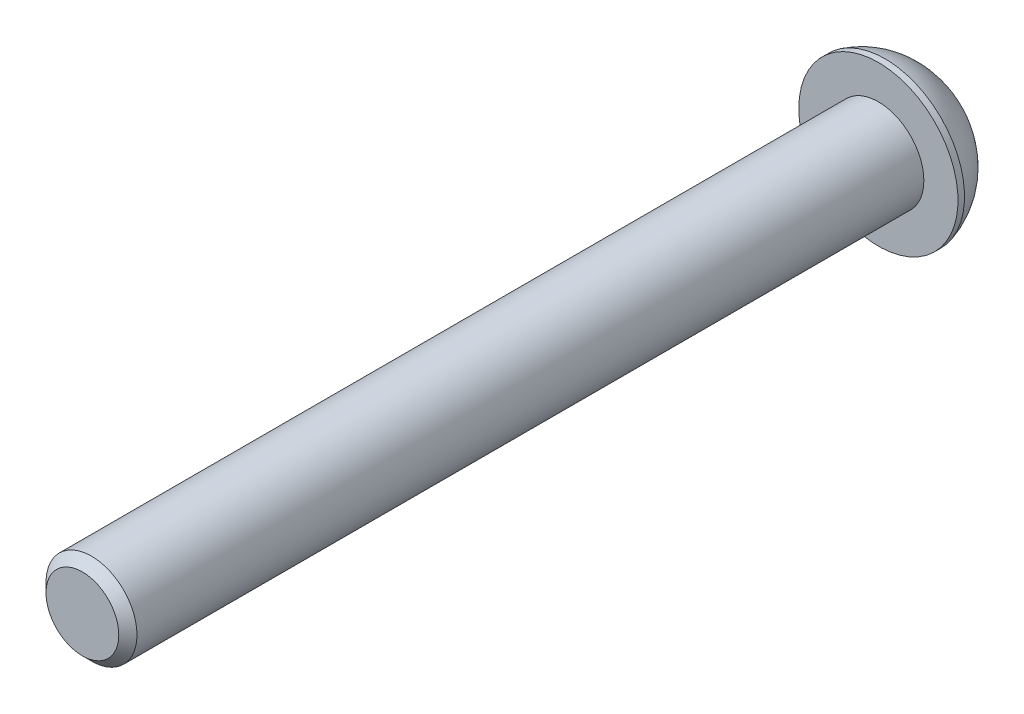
ISO-10303-21;
HEADER;
FILE_DESCRIPTION(('STEP AP214'),'2;1');
FILE_NAME('part.step','',(''),(''),'','','');
FILE_SCHEMA(('AUTOMOTIVE_DESIGN { 1 0 10303 214 1 1 1 1 }'));
ENDSEC;
DATA;
#1=APPLICATION_CONTEXT('core data for automotive mechanical design processes');
#2=APPLICATION_PROTOCOL_DEFINITION('international standard','automotive_design',2000,#1);
#3=PRODUCT_CONTEXT('',#1,'mechanical');
#4=PRODUCT('Part','Part','',(#3));
#5=PRODUCT_RELATED_PRODUCT_CATEGORY('part','',(#4));
#6=PRODUCT_DEFINITION_FORMATION('','',#4);
#7=PRODUCT_DEFINITION_CONTEXT('part definition',#1,'design');
#8=PRODUCT_DEFINITION('design','',#6,#7);
#9=PRODUCT_DEFINITION_SHAPE('','',#8);
#10=(LENGTH_UNIT() NAMED_UNIT(*) SI_UNIT(.MILLI.,.METRE.));
#11=(NAMED_UNIT(*) PLANE_ANGLE_UNIT() SI_UNIT($,.RADIAN.));
#12=(NAMED_UNIT(*) SI_UNIT($,.STERADIAN.) SOLID_ANGLE_UNIT());
#13=UNCERTAINTY_MEASURE_WITH_UNIT(LENGTH_MEASURE(1.E-05),#10,'distance_accuracy_value','');
#14=(GEOMETRIC_REPRESENTATION_CONTEXT(3) GLOBAL_UNCERTAINTY_ASSIGNED_CONTEXT((#13)) GLOBAL_UNIT_ASSIGNED_CONTEXT((#10,
#11,#12)) REPRESENTATION_CONTEXT('',''));
#15=CARTESIAN_POINT('',(0.,0.,0.));
#16=DIRECTION('',(0.,0.,1.));
#17=DIRECTION('',(1.,0.,0.));
#18=AXIS2_PLACEMENT_3D('',#15,#16,#17);
#19=CARTESIAN_POINT('',(0.,0.,-4.4));
#20=DIRECTION('',(0.,0.,1.));
#21=DIRECTION('',(1.,0.,0.));
#22=AXIS2_PLACEMENT_3D('',#19,#20,#21);
#23=PLANE('',#22);
#24=CARTESIAN_POINT('',(0.,0.,-4.4));
#25=DIRECTION('',(0.,0.,-1.));
#26=DIRECTION('',(-1.,0.,0.));
#27=AXIS2_PLACEMENT_3D('',#24,#25,#26);
#28=CIRCLE('',#27,4.06492341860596);
#29=CARTESIAN_POINT('',(-4.06492341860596,0.,-4.4));
#30=VERTEX_POINT('',#29);
#31=EDGE_CURVE('E148',#30,#30,#28,.T.);
#32=ORIENTED_EDGE('',*,*,#31,.T.);
#33=EDGE_LOOP('',(#32));
#34=FACE_BOUND('',#33,.T.);
#35=DIRECTION('',(-0.86602540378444,0.499999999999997,0.));
#36=VECTOR('',#35,1.);
#37=CARTESIAN_POINT('',(0.,2.88675134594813,-4.4));
#38=LINE('',#37,#36);
#39=CARTESIAN_POINT('',(2.5,1.44337567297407,-4.4));
#40=VERTEX_POINT('',#39);
#41=CARTESIAN_POINT('',(0.,2.88675134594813,-4.4));
#42=VERTEX_POINT('',#41);
#43=EDGE_CURVE('E50',#40,#42,#38,.T.);
#44=ORIENTED_EDGE('',*,*,#43,.T.);
#45=DIRECTION('',(-0.866025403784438,-0.500000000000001,0.));
#46=VECTOR('',#45,1.);
#47=CARTESIAN_POINT('',(0.,2.88675134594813,-4.4));
#48=LINE('',#47,#46);
#49=CARTESIAN_POINT('',(-2.5,1.44337567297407,-4.4));
#50=VERTEX_POINT('',#49);
#51=EDGE_CURVE('E121',#42,#50,#48,.T.);
#52=ORIENTED_EDGE('',*,*,#51,.T.);
#53=DIRECTION('',(0.,-1.,0.));
#54=VECTOR('',#53,1.);
#55=CARTESIAN_POINT('',(-2.5,-1.44337567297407,-4.4));
#56=LINE('',#55,#54);
#57=CARTESIAN_POINT('',(-2.5,-1.44337567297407,-4.4));
#58=VERTEX_POINT('',#57);
#59=EDGE_CURVE('E125',#50,#58,#56,.T.);
#60=ORIENTED_EDGE('',*,*,#59,.T.);
#61=DIRECTION('',(0.866025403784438,-0.500000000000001,0.));
#62=VECTOR('',#61,1.);
#63=CARTESIAN_POINT('',(0.,-2.88675134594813,-4.4));
#64=LINE('',#63,#62);
#65=CARTESIAN_POINT('',(0.,-2.88675134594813,-4.4));
#66=VERTEX_POINT('',#65);
#67=EDGE_CURVE('E128',#58,#66,#64,.T.);
#68=ORIENTED_EDGE('',*,*,#67,.T.);
#69=DIRECTION('',(0.86602540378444,0.499999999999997,0.));
#70=VECTOR('',#69,1.);
#71=CARTESIAN_POINT('',(0.,-2.88675134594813,-4.4));
#72=LINE('',#71,#70);
#73=CARTESIAN_POINT('',(2.5,-1.44337567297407,-4.4));
#74=VERTEX_POINT('',#73);
#75=EDGE_CURVE('E111',#66,#74,#72,.T.);
#76=ORIENTED_EDGE('',*,*,#75,.T.);
#77=DIRECTION('',(0.,1.,0.));
#78=VECTOR('',#77,1.);
#79=CARTESIAN_POINT('',(2.5,-1.44337567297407,-4.4));
#80=LINE('',#79,#78);
#81=EDGE_CURVE('E131',#74,#40,#80,.T.);
#82=ORIENTED_EDGE('',*,*,#81,.T.);
#83=EDGE_LOOP('',(#44,#52,#60,#68,#76,#82));
#84=FACE_BOUND('',#83,.T.);
#85=ADVANCED_FACE('F35',(#34,#84),#23,.F.);
#86=CARTESIAN_POINT('',(0.,0.,1.05548398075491));
#87=DIRECTION('',(0.,0.,-1.));
#88=DIRECTION('',(-1.,0.,0.));
#89=AXIS2_PLACEMENT_3D('',#86,#87,#88);
#90=DEGENERATE_TOROIDAL_SURFACE('',#89,0.915198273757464,6.29945028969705,.T.);
#91=ORIENTED_EDGE('',*,*,#31,.F.);
#92=EDGE_LOOP('',(#91));
#93=FACE_BOUND('',#92,.T.);
#94=CARTESIAN_POINT('',(0.,0.,-0.574933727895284));
#95=DIRECTION('',(0.,0.,-1.));
#96=DIRECTION('',(-1.,0.,0.));
#97=AXIS2_PLACEMENT_3D('',#94,#95,#96);
#98=CIRCLE('',#97,7.);
#99=CARTESIAN_POINT('',(-7.,0.,-0.574933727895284));
#100=VERTEX_POINT('',#99);
#101=EDGE_CURVE('E145',#100,#100,#98,.T.);
#102=ORIENTED_EDGE('',*,*,#101,.T.);
#103=EDGE_LOOP('',(#102));
#104=FACE_BOUND('',#103,.T.);
#105=ADVANCED_FACE('F165',(#93,#104),#90,.T.);
#106=CARTESIAN_POINT('',(0.,0.,0.));
#107=DIRECTION('',(0.,0.,-1.));
#108=DIRECTION('',(-1.,0.,0.));
#109=AXIS2_PLACEMENT_3D('',#106,#107,#108);
#110=CYLINDRICAL_SURFACE('',#109,7.);
#111=ORIENTED_EDGE('',*,*,#101,.F.);
#112=EDGE_LOOP('',(#111));
#113=FACE_BOUND('',#112,.T.);
#114=CARTESIAN_POINT('',(0.,0.,0.));
#115=DIRECTION('',(0.,0.,-1.));
#116=DIRECTION('',(-1.,0.,0.));
#117=AXIS2_PLACEMENT_3D('',#114,#115,#116);
#118=CIRCLE('',#117,7.);
#119=CARTESIAN_POINT('',(-7.,0.,0.));
#120=VERTEX_POINT('',#119);
#121=EDGE_CURVE('E142',#120,#120,#118,.T.);
#122=ORIENTED_EDGE('',*,*,#121,.T.);
#123=EDGE_LOOP('',(#122));
#124=FACE_BOUND('',#123,.T.);
#125=ADVANCED_FACE('F170',(#113,#124),#110,.T.);
#126=CARTESIAN_POINT('',(0.,0.,0.));
#127=DIRECTION('',(0.,0.,-1.));
#128=DIRECTION('',(-1.,0.,0.));
#129=AXIS2_PLACEMENT_3D('',#126,#127,#128);
#130=PLANE('',#129);
#131=CARTESIAN_POINT('',(0.,0.,0.));
#132=DIRECTION('',(0.,0.,1.));
#133=DIRECTION('',(1.,0.,0.));
#134=AXIS2_PLACEMENT_3D('',#131,#132,#133);
#135=CIRCLE('',#134,4.);
#136=CARTESIAN_POINT('',(4.,0.,0.));
#137=VERTEX_POINT('',#136);
#138=EDGE_CURVE('E122',#137,#137,#135,.T.);
#139=ORIENTED_EDGE('',*,*,#138,.F.);
#140=EDGE_LOOP('',(#139));
#141=FACE_BOUND('',#140,.T.);
#142=ORIENTED_EDGE('',*,*,#121,.F.);
#143=EDGE_LOOP('',(#142));
#144=FACE_BOUND('',#143,.T.);
#145=ADVANCED_FACE('F177',(#141,#144),#130,.F.);
#146=CARTESIAN_POINT('',(0.,2.88675134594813,-1.8));
#147=DIRECTION('',(-0.499999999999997,-0.86602540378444,0.));
#148=DIRECTION('',(0.86602540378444,-0.499999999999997,0.));
#149=AXIS2_PLACEMENT_3D('',#146,#147,#148);
#150=PLANE('',#149);
#151=ORIENTED_EDGE('',*,*,#43,.F.);
#152=DIRECTION('',(0.,0.,-1.));
#153=VECTOR('',#152,1.);
#154=CARTESIAN_POINT('',(2.5,1.44337567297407,-1.8));
#155=LINE('',#154,#153);
#156=CARTESIAN_POINT('',(2.5,1.44337567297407,-1.8));
#157=VERTEX_POINT('',#156);
#158=EDGE_CURVE('E116',#157,#40,#155,.T.);
#159=ORIENTED_EDGE('',*,*,#158,.F.);
#160=DIRECTION('',(-0.86602540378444,0.499999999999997,0.));
#161=VECTOR('',#160,1.);
#162=CARTESIAN_POINT('',(0.,2.88675134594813,-1.8));
#163=LINE('',#162,#161);
#164=CARTESIAN_POINT('',(0.,2.88675134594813,-1.8));
#165=VERTEX_POINT('',#164);
#166=EDGE_CURVE('E134',#157,#165,#163,.T.);
#167=ORIENTED_EDGE('',*,*,#166,.T.);
#168=DIRECTION('',(0.,0.,-1.));
#169=VECTOR('',#168,1.);
#170=CARTESIAN_POINT('',(0.,2.88675134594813,-1.8));
#171=LINE('',#170,#169);
#172=EDGE_CURVE('E140',#165,#42,#171,.T.);
#173=ORIENTED_EDGE('',*,*,#172,.T.);
#174=EDGE_LOOP('',(#151,#159,#167,#173));
#175=FACE_BOUND('',#174,.T.);
#176=ADVANCED_FACE('F181',(#175),#150,.T.);
#177=CARTESIAN_POINT('',(0.,2.88675134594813,-1.8));
#178=DIRECTION('',(0.500000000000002,-0.866025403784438,0.));
#179=DIRECTION('',(0.866025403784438,0.500000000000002,0.));
#180=AXIS2_PLACEMENT_3D('',#177,#178,#179);
#181=PLANE('',#180);
#182=ORIENTED_EDGE('',*,*,#51,.F.);
#183=ORIENTED_EDGE('',*,*,#172,.F.);
#184=DIRECTION('',(-0.866025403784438,-0.500000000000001,0.));
#185=VECTOR('',#184,1.);
#186=CARTESIAN_POINT('',(0.,2.88675134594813,-1.8));
#187=LINE('',#186,#185);
#188=CARTESIAN_POINT('',(-2.5,1.44337567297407,-1.8));
#189=VERTEX_POINT('',#188);
#190=EDGE_CURVE('E89',#165,#189,#187,.T.);
#191=ORIENTED_EDGE('',*,*,#190,.T.);
#192=DIRECTION('',(0.,0.,-1.));
#193=VECTOR('',#192,1.);
#194=CARTESIAN_POINT('',(-2.5,1.44337567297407,-1.8));
#195=LINE('',#194,#193);
#196=EDGE_CURVE('E138',#189,#50,#195,.T.);
#197=ORIENTED_EDGE('',*,*,#196,.T.);
#198=EDGE_LOOP('',(#182,#183,#191,#197));
#199=FACE_BOUND('',#198,.T.);
#200=ADVANCED_FACE('F185',(#199),#181,.T.);
#201=CARTESIAN_POINT('',(-2.5,-1.44337567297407,-1.8));
#202=DIRECTION('',(1.,0.,0.));
#203=DIRECTION('',(0.,0.,-1.));
#204=AXIS2_PLACEMENT_3D('',#201,#202,#203);
#205=PLANE('',#204);
#206=ORIENTED_EDGE('',*,*,#59,.F.);
#207=ORIENTED_EDGE('',*,*,#196,.F.);
#208=DIRECTION('',(0.,-1.,0.));
#209=VECTOR('',#208,1.);
#210=CARTESIAN_POINT('',(-2.5,-1.44337567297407,-1.8));
#211=LINE('',#210,#209);
#212=CARTESIAN_POINT('',(-2.5,-1.44337567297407,-1.8));
#213=VERTEX_POINT('',#212);
#214=EDGE_CURVE('E107',#189,#213,#211,.T.);
#215=ORIENTED_EDGE('',*,*,#214,.T.);
#216=DIRECTION('',(0.,0.,-1.));
#217=VECTOR('',#216,1.);
#218=CARTESIAN_POINT('',(-2.5,-1.44337567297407,-1.8));
#219=LINE('',#218,#217);
#220=EDGE_CURVE('E104',#213,#58,#219,.T.);
#221=ORIENTED_EDGE('',*,*,#220,.T.);
#222=EDGE_LOOP('',(#206,#207,#215,#221));
#223=FACE_BOUND('',#222,.T.);
#224=ADVANCED_FACE('F188',(#223),#205,.T.);
#225=CARTESIAN_POINT('',(0.,-2.88675134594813,-1.8));
#226=DIRECTION('',(0.500000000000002,0.866025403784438,0.));
#227=DIRECTION('',(-0.866025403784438,0.500000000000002,0.));
#228=AXIS2_PLACEMENT_3D('',#225,#226,#227);
#229=PLANE('',#228);
#230=ORIENTED_EDGE('',*,*,#67,.F.);
#231=ORIENTED_EDGE('',*,*,#220,.F.);
#232=DIRECTION('',(0.866025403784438,-0.500000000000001,0.));
#233=VECTOR('',#232,1.);
#234=CARTESIAN_POINT('',(0.,-2.88675134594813,-1.8));
#235=LINE('',#234,#233);
#236=CARTESIAN_POINT('',(0.,-2.88675134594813,-1.8));
#237=VERTEX_POINT('',#236);
#238=EDGE_CURVE('E99',#213,#237,#235,.T.);
#239=ORIENTED_EDGE('',*,*,#238,.T.);
#240=DIRECTION('',(0.,0.,-1.));
#241=VECTOR('',#240,1.);
#242=CARTESIAN_POINT('',(0.,-2.88675134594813,-1.8));
#243=LINE('',#242,#241);
#244=EDGE_CURVE('E103',#237,#66,#243,.T.);
#245=ORIENTED_EDGE('',*,*,#244,.T.);
#246=EDGE_LOOP('',(#230,#231,#239,#245));
#247=FACE_BOUND('',#246,.T.);
#248=ADVANCED_FACE('F102',(#247),#229,.T.);
#249=CARTESIAN_POINT('',(0.,-2.88675134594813,-1.8));
#250=DIRECTION('',(-0.499999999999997,0.86602540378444,0.));
#251=DIRECTION('',(-0.86602540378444,-0.499999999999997,0.));
#252=AXIS2_PLACEMENT_3D('',#249,#250,#251);
#253=PLANE('',#252);
#254=ORIENTED_EDGE('',*,*,#75,.F.);
#255=ORIENTED_EDGE('',*,*,#244,.F.);
#256=DIRECTION('',(0.86602540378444,0.499999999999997,0.));
#257=VECTOR('',#256,1.);
#258=CARTESIAN_POINT('',(0.,-2.88675134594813,-1.8));
#259=LINE('',#258,#257);
#260=CARTESIAN_POINT('',(2.5,-1.44337567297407,-1.8));
#261=VERTEX_POINT('',#260);
#262=EDGE_CURVE('E106',#237,#261,#259,.T.);
#263=ORIENTED_EDGE('',*,*,#262,.T.);
#264=DIRECTION('',(0.,0.,-1.));
#265=VECTOR('',#264,1.);
#266=CARTESIAN_POINT('',(2.5,-1.44337567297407,-1.8));
#267=LINE('',#266,#265);
#268=EDGE_CURVE('E80',#261,#74,#267,.T.);
#269=ORIENTED_EDGE('',*,*,#268,.T.);
#270=EDGE_LOOP('',(#254,#255,#263,#269));
#271=FACE_BOUND('',#270,.T.);
#272=ADVANCED_FACE('F109',(#271),#253,.T.);
#273=CARTESIAN_POINT('',(2.5,-1.44337567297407,-1.8));
#274=DIRECTION('',(-1.,0.,0.));
#275=DIRECTION('',(0.,0.,1.));
#276=AXIS2_PLACEMENT_3D('',#273,#274,#275);
#277=PLANE('',#276);
#278=ORIENTED_EDGE('',*,*,#81,.F.);
#279=ORIENTED_EDGE('',*,*,#268,.F.);
#280=DIRECTION('',(0.,1.,0.));
#281=VECTOR('',#280,1.);
#282=CARTESIAN_POINT('',(2.5,-1.44337567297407,-1.8));
#283=LINE('',#282,#281);
#284=EDGE_CURVE('E58',#261,#157,#283,.T.);
#285=ORIENTED_EDGE('',*,*,#284,.T.);
#286=ORIENTED_EDGE('',*,*,#158,.T.);
#287=EDGE_LOOP('',(#278,#279,#285,#286));
#288=FACE_BOUND('',#287,.T.);
#289=ADVANCED_FACE('F197',(#288),#277,.T.);
#290=CARTESIAN_POINT('',(2.5,1.44337567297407,-1.8));
#291=DIRECTION('',(0.,0.,1.));
#292=DIRECTION('',(1.,0.,0.));
#293=AXIS2_PLACEMENT_3D('',#290,#291,#292);
#294=PLANE('',#293);
#295=ORIENTED_EDGE('',*,*,#166,.F.);
#296=ORIENTED_EDGE('',*,*,#284,.F.);
#297=ORIENTED_EDGE('',*,*,#262,.F.);
#298=ORIENTED_EDGE('',*,*,#238,.F.);
#299=ORIENTED_EDGE('',*,*,#214,.F.);
#300=ORIENTED_EDGE('',*,*,#190,.F.);
#301=EDGE_LOOP('',(#295,#296,#297,#298,#299,#300));
#302=FACE_BOUND('',#301,.T.);
#303=ADVANCED_FACE('F114',(#302),#294,.F.);
#304=CARTESIAN_POINT('',(0.,0.,70.));
#305=DIRECTION('',(0.,0.,1.));
#306=DIRECTION('',(1.,0.,0.));
#307=AXIS2_PLACEMENT_3D('',#304,#305,#306);
#308=PLANE('',#307);
#309=CARTESIAN_POINT('',(0.,0.,70.));
#310=DIRECTION('',(0.,0.,1.));
#311=DIRECTION('',(1.,0.,0.));
#312=AXIS2_PLACEMENT_3D('',#309,#310,#311);
#313=CIRCLE('',#312,3.20000000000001);
#314=CARTESIAN_POINT('',(3.20000000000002,0.,70.));
#315=VERTEX_POINT('',#314);
#316=EDGE_CURVE('E43',#315,#315,#313,.T.);
#317=ORIENTED_EDGE('',*,*,#316,.T.);
#318=EDGE_LOOP('',(#317));
#319=FACE_BOUND('',#318,.T.);
#320=ADVANCED_FACE('F153',(#319),#308,.T.);
#321=CARTESIAN_POINT('',(0.,0.,0.));
#322=DIRECTION('',(0.,0.,1.));
#323=DIRECTION('',(1.,0.,0.));
#324=AXIS2_PLACEMENT_3D('',#321,#322,#323);
#325=CYLINDRICAL_SURFACE('',#324,4.);
#326=CARTESIAN_POINT('',(0.,0.,69.2));
#327=DIRECTION('',(0.,0.,1.));
#328=DIRECTION('',(1.,0.,0.));
#329=AXIS2_PLACEMENT_3D('',#326,#327,#328);
#330=CIRCLE('',#329,4.);
#331=CARTESIAN_POINT('',(4.00000000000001,0.,69.2));
#332=VERTEX_POINT('',#331);
#333=EDGE_CURVE('E11',#332,#332,#330,.F.);
#334=ORIENTED_EDGE('',*,*,#333,.T.);
#335=EDGE_LOOP('',(#334));
#336=FACE_BOUND('',#335,.T.);
#337=ORIENTED_EDGE('',*,*,#138,.T.);
#338=EDGE_LOOP('',(#337));
#339=FACE_BOUND('',#338,.T.);
#340=ADVANCED_FACE('F156',(#336,#339),#325,.T.);
#341=CARTESIAN_POINT('',(0.,0.,70.));
#342=DIRECTION('',(0.,0.,-1.));
#343=DIRECTION('',(-1.,0.,0.));
#344=AXIS2_PLACEMENT_3D('',#341,#342,#343);
#345=CONICAL_SURFACE('',#344,3.20000000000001,0.785398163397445);
#346=ORIENTED_EDGE('',*,*,#333,.F.);
#347=EDGE_LOOP('',(#346));
#348=FACE_BOUND('',#347,.T.);
#349=ORIENTED_EDGE('',*,*,#316,.F.);
#350=EDGE_LOOP('',(#349));
#351=FACE_BOUND('',#350,.T.);
#352=ADVANCED_FACE('F37',(#348,#351),#345,.T.);
#353=CLOSED_SHELL('',(#85,#105,#125,#145,#176,#200,#224,#248,#272,#289,#303,#320,#340,#352));
#354=MANIFOLD_SOLID_BREP('B2',#353);
#355=ADVANCED_BREP_SHAPE_REPRESENTATION('',(#18,#354),#14);
#356=SHAPE_DEFINITION_REPRESENTATION(#9,#355);
ENDSEC;
END-ISO-10303-21;
